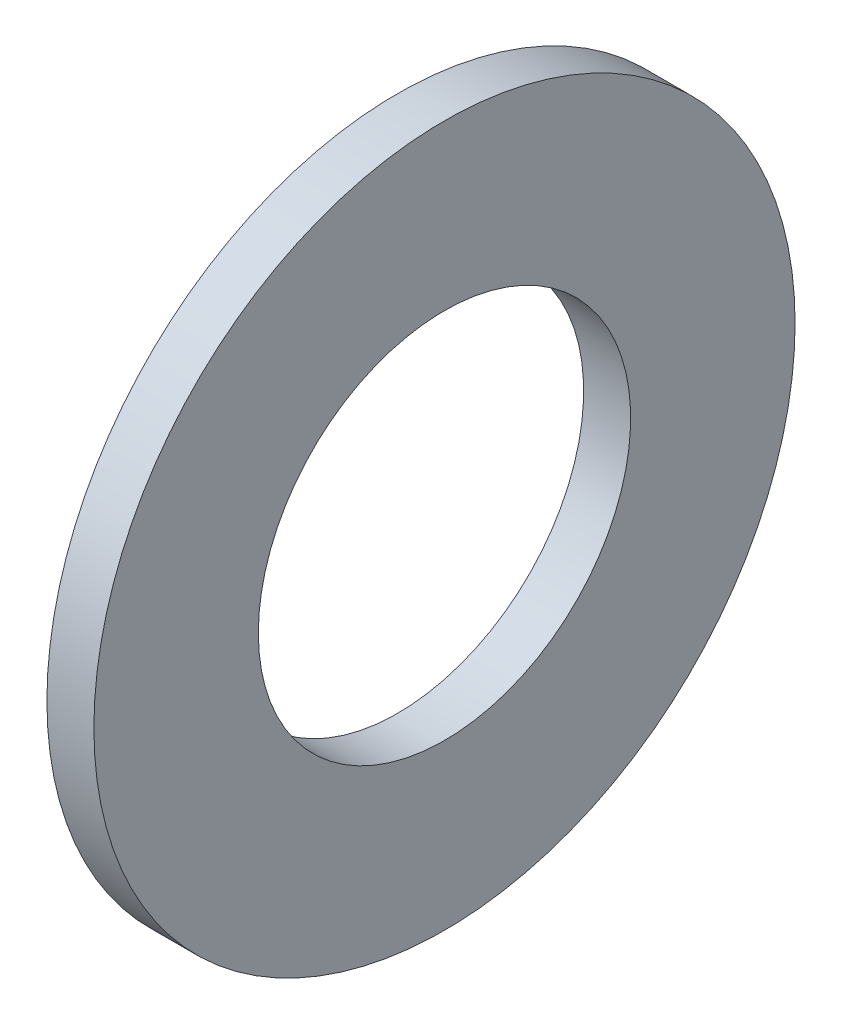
from build123d import *

# Parameters (mm, degrees)
SKETCH1_W = 3.4036
SKETCH1_H = 11.9126


with BuildPart() as part:
    # Sketch1 → Base-Revolve (revolve)
    with BuildSketch(Plane.XY, mode=Mode.PRIVATE) as base_revolve_sk:
        with Locations((-1.7018, 19.4437)):
            Rectangle(SKETCH1_W, SKETCH1_H)
    revolve(base_revolve_sk.sketch.rotate(Axis((-34.925, 0, 0), (1, 0, 0)), 90), axis=Axis((-34.925, 0, 0), (1, 0, 0)))


solid = part.part
